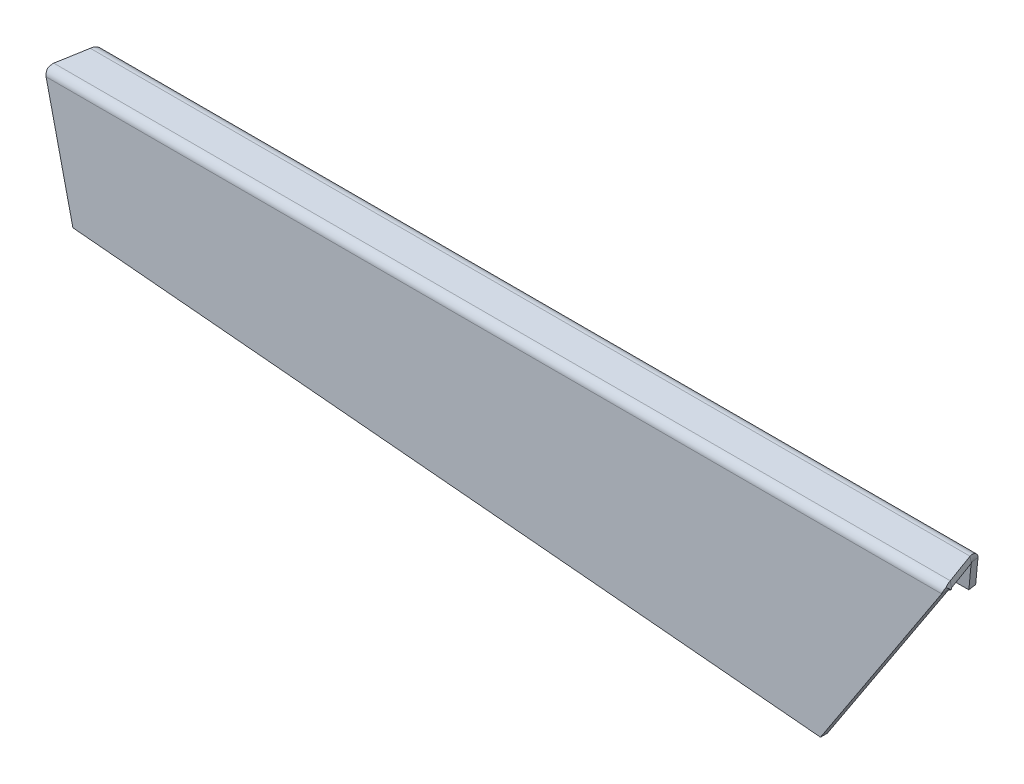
ISO-10303-21;
HEADER;
FILE_DESCRIPTION(('STEP AP214'),'2;1');
FILE_NAME('part.step','',(''),(''),'','','');
FILE_SCHEMA(('AUTOMOTIVE_DESIGN { 1 0 10303 214 1 1 1 1 }'));
ENDSEC;
DATA;
#1=APPLICATION_CONTEXT('core data for automotive mechanical design processes');
#2=APPLICATION_PROTOCOL_DEFINITION('international standard','automotive_design',2000,#1);
#3=PRODUCT_CONTEXT('',#1,'mechanical');
#4=PRODUCT('Part','Part','',(#3));
#5=PRODUCT_RELATED_PRODUCT_CATEGORY('part','',(#4));
#6=PRODUCT_DEFINITION_FORMATION('','',#4);
#7=PRODUCT_DEFINITION_CONTEXT('part definition',#1,'design');
#8=PRODUCT_DEFINITION('design','',#6,#7);
#9=PRODUCT_DEFINITION_SHAPE('','',#8);
#10=(LENGTH_UNIT() NAMED_UNIT(*) SI_UNIT(.MILLI.,.METRE.));
#11=(NAMED_UNIT(*) PLANE_ANGLE_UNIT() SI_UNIT($,.RADIAN.));
#12=(NAMED_UNIT(*) SI_UNIT($,.STERADIAN.) SOLID_ANGLE_UNIT());
#13=UNCERTAINTY_MEASURE_WITH_UNIT(LENGTH_MEASURE(1.E-05),#10,'distance_accuracy_value','');
#14=(GEOMETRIC_REPRESENTATION_CONTEXT(3) GLOBAL_UNCERTAINTY_ASSIGNED_CONTEXT((#13)) GLOBAL_UNIT_ASSIGNED_CONTEXT((#10,
#11,#12)) REPRESENTATION_CONTEXT('',''));
#15=CARTESIAN_POINT('',(0.,0.,0.));
#16=DIRECTION('',(0.,0.,1.));
#17=DIRECTION('',(1.,0.,0.));
#18=AXIS2_PLACEMENT_3D('',#15,#16,#17);
#19=CARTESIAN_POINT('',(-143.,-40.8018532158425,217.160539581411));
#20=DIRECTION('',(0.,0.984807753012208,0.173648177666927));
#21=DIRECTION('',(1.,0.,0.));
#22=AXIS2_PLACEMENT_3D('',#19,#20,#21);
#23=PLANE('',#22);
#24=DIRECTION('',(-0.351123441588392,-0.162591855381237,0.92210423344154));
#25=VECTOR('',#24,1.);
#26=CARTESIAN_POINT('',(-1010.,10.9453037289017,-76.3121708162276));
#27=LINE('',#26,#25);
#28=CARTESIAN_POINT('',(-1026.76714586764,3.18107886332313,-32.2790634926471));
#29=VERTEX_POINT('',#28);
#30=CARTESIAN_POINT('',(-1038.42920367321,-2.21917469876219,-1.65270364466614));
#31=VERTEX_POINT('',#30);
#32=EDGE_CURVE('E600',#29,#31,#27,.T.);
#33=ORIENTED_EDGE('',*,*,#32,.F.);
#34=DIRECTION('',(1.,0.,0.));
#35=VECTOR('',#34,1.);
#36=CARTESIAN_POINT('',(-143.,3.18107886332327,-32.2790634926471));
#37=LINE('',#36,#35);
#38=CARTESIAN_POINT('',(-8.82190275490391,3.18107886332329,-32.2790634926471));
#39=VERTEX_POINT('',#38);
#40=EDGE_CURVE('E99',#29,#39,#37,.T.);
#41=ORIENTED_EDGE('',*,*,#40,.T.);
#42=DIRECTION('',(-0.242535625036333,0.168463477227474,-0.95540385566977));
#43=VECTOR('',#42,1.);
#44=CARTESIAN_POINT('',(0.,-2.94655048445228,2.47244942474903));
#45=LINE('',#44,#43);
#46=CARTESIAN_POINT('',(-1.04719755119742,-2.21917469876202,-1.65270364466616));
#47=VERTEX_POINT('',#46);
#48=EDGE_CURVE('E523',#47,#39,#45,.T.);
#49=ORIENTED_EDGE('',*,*,#48,.F.);
#50=DIRECTION('',(1.,0.,0.));
#51=VECTOR('',#50,1.);
#52=CARTESIAN_POINT('',(-143.,-2.21917469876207,-1.65270364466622));
#53=LINE('',#52,#51);
#54=EDGE_CURVE('E629',#31,#47,#53,.T.);
#55=ORIENTED_EDGE('',*,*,#54,.F.);
#56=EDGE_LOOP('',(#33,#41,#49,#55));
#57=FACE_BOUND('',#56,.T.);
#58=ADVANCED_FACE('F87',(#57),#23,.F.);
#59=CARTESIAN_POINT('',(-1010.,18.8237657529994,-74.9229853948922));
#60=DIRECTION('',(0.936329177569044,-0.060971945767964,0.345789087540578));
#61=DIRECTION('',(0.351123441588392,0.162591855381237,-0.92210423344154));
#62=AXIS2_PLACEMENT_3D('',#59,#60,#61);
#63=PLANE('',#62);
#64=DIRECTION('',(-0.351123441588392,-0.162591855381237,0.92210423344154));
#65=VECTOR('',#64,1.);
#66=CARTESIAN_POINT('',(-1010.,18.8237657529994,-74.9229853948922));
#67=LINE('',#66,#65);
#68=CARTESIAN_POINT('',(-1026.76714586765,11.0595408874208,-30.8898780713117));
#69=VERTEX_POINT('',#68);
#70=CARTESIAN_POINT('',(-1038.42920367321,5.65928732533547,-0.26351822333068));
#71=VERTEX_POINT('',#70);
#72=EDGE_CURVE('E594',#69,#71,#67,.T.);
#73=ORIENTED_EDGE('',*,*,#72,.F.);
#74=CARTESIAN_POINT('',(-1026.76714586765,3.18107886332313,-32.2790634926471));
#75=CARTESIAN_POINT('',(-1026.76714586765,11.0595408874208,-30.8898780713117));
#76=B_SPLINE_CURVE_WITH_KNOTS('',1,(#74,#75),.UNSPECIFIED.,.F.,.F.,(2,2),(0.,1.),.UNSPECIFIED.);
#77=EDGE_CURVE('E12',#69,#29,#76,.F.);
#78=ORIENTED_EDGE('',*,*,#77,.T.);
#79=ORIENTED_EDGE('',*,*,#32,.T.);
#80=CARTESIAN_POINT('',(-1038.42920367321,5.65928732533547,-0.26351822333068));
#81=CARTESIAN_POINT('',(-1038.42920367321,-2.21917469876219,-1.65270364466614));
#82=B_SPLINE_CURVE_WITH_KNOTS('',1,(#80,#81),.UNSPECIFIED.,.F.,.F.,(2,2),(0.,1.),.UNSPECIFIED.);
#83=EDGE_CURVE('E477',#71,#31,#82,.T.);
#84=ORIENTED_EDGE('',*,*,#83,.F.);
#85=EDGE_LOOP('',(#73,#78,#79,#84));
#86=FACE_BOUND('',#85,.T.);
#87=ADVANCED_FACE('F89',(#86),#63,.F.);
#88=CARTESIAN_POINT('',(0.,4.93191153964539,3.86163484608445));
#89=DIRECTION('',(-0.970142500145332,-0.0421158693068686,0.238850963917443));
#90=DIRECTION('',(0.242535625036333,-0.168463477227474,0.95540385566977));
#91=AXIS2_PLACEMENT_3D('',#88,#89,#90);
#92=PLANE('',#91);
#93=ORIENTED_EDGE('',*,*,#48,.T.);
#94=CARTESIAN_POINT('',(-8.82190275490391,11.059540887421,-30.8898780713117));
#95=CARTESIAN_POINT('',(-8.82190275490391,3.18107886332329,-32.2790634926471));
#96=B_SPLINE_CURVE_WITH_KNOTS('',1,(#94,#95),.UNSPECIFIED.,.F.,.F.,(2,2),(0.,1.),.UNSPECIFIED.);
#97=CARTESIAN_POINT('',(-8.82190275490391,11.059540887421,-30.8898780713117));
#98=VERTEX_POINT('',#97);
#99=EDGE_CURVE('E331',#39,#98,#96,.F.);
#100=ORIENTED_EDGE('',*,*,#99,.T.);
#101=DIRECTION('',(-0.242535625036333,0.168463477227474,-0.95540385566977));
#102=VECTOR('',#101,1.);
#103=CARTESIAN_POINT('',(0.,4.93191153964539,3.86163484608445));
#104=LINE('',#103,#102);
#105=CARTESIAN_POINT('',(-1.0471975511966,5.65928732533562,-0.263518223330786));
#106=VERTEX_POINT('',#105);
#107=EDGE_CURVE('E597',#106,#98,#104,.T.);
#108=ORIENTED_EDGE('',*,*,#107,.F.);
#109=CARTESIAN_POINT('',(-1.04719755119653,-2.21917469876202,-1.65270364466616));
#110=CARTESIAN_POINT('',(-1.04719755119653,5.65928732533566,-0.26351822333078));
#111=B_SPLINE_CURVE_WITH_KNOTS('',1,(#109,#110),.UNSPECIFIED.,.F.,.F.,(2,2),(0.,1.),.UNSPECIFIED.);
#112=EDGE_CURVE('E489',#47,#106,#111,.T.);
#113=ORIENTED_EDGE('',*,*,#112,.F.);
#114=EDGE_LOOP('',(#93,#100,#108,#113));
#115=FACE_BOUND('',#114,.T.);
#116=ADVANCED_FACE('F627',(#115),#92,.F.);
#117=CARTESIAN_POINT('',(-143.,-32.9233911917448,218.549725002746));
#118=DIRECTION('',(0.,0.984807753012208,0.173648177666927));
#119=DIRECTION('',(1.,0.,0.));
#120=AXIS2_PLACEMENT_3D('',#117,#118,#119);
#121=PLANE('',#120);
#122=DIRECTION('',(1.,0.,0.));
#123=VECTOR('',#122,1.);
#124=CARTESIAN_POINT('',(-143.,11.0595408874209,-30.8898780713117));
#125=LINE('',#124,#123);
#126=EDGE_CURVE('E628',#69,#98,#125,.T.);
#127=ORIENTED_EDGE('',*,*,#126,.F.);
#128=ORIENTED_EDGE('',*,*,#72,.T.);
#129=DIRECTION('',(1.,0.,0.));
#130=VECTOR('',#129,1.);
#131=CARTESIAN_POINT('',(-143.,5.65928732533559,-0.263518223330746));
#132=LINE('',#131,#130);
#133=EDGE_CURVE('E592',#71,#106,#132,.T.);
#134=ORIENTED_EDGE('',*,*,#133,.T.);
#135=ORIENTED_EDGE('',*,*,#107,.T.);
#136=EDGE_LOOP('',(#127,#128,#134,#135));
#137=FACE_BOUND('',#136,.T.);
#138=ADVANCED_FACE('F574',(#137),#121,.T.);
#139=CARTESIAN_POINT('',(-1008.,-140.,8.));
#140=DIRECTION('',(0.0898090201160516,0.99595900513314,0.));
#141=DIRECTION('',(-0.99595900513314,0.0898090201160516,0.));
#142=AXIS2_PLACEMENT_3D('',#139,#140,#141);
#143=PLANE('',#142);
#144=DIRECTION('',(0.99595900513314,-0.0898090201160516,0.));
#145=VECTOR('',#144,1.);
#146=CARTESIAN_POINT('',(-1008.,-140.,0.));
#147=LINE('',#146,#145);
#148=CARTESIAN_POINT('',(-1008.,-140.,0.));
#149=VERTEX_POINT('',#148);
#150=CARTESIAN_POINT('',(-143.,-218.,0.));
#151=VERTEX_POINT('',#150);
#152=EDGE_CURVE('E532',#149,#151,#147,.T.);
#153=ORIENTED_EDGE('',*,*,#152,.T.);
#154=DIRECTION('',(0.,0.,-1.));
#155=VECTOR('',#154,1.);
#156=CARTESIAN_POINT('',(-143.,-218.,8.));
#157=LINE('',#156,#155);
#158=CARTESIAN_POINT('',(-143.,-218.,8.));
#159=VERTEX_POINT('',#158);
#160=EDGE_CURVE('E515',#159,#151,#157,.T.);
#161=ORIENTED_EDGE('',*,*,#160,.F.);
#162=DIRECTION('',(0.99595900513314,-0.0898090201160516,0.));
#163=VECTOR('',#162,1.);
#164=CARTESIAN_POINT('',(-1008.,-140.,8.));
#165=LINE('',#164,#163);
#166=CARTESIAN_POINT('',(-1008.,-140.,8.));
#167=VERTEX_POINT('',#166);
#168=EDGE_CURVE('E525',#167,#159,#165,.T.);
#169=ORIENTED_EDGE('',*,*,#168,.F.);
#170=DIRECTION('',(0.,0.,-1.));
#171=VECTOR('',#170,1.);
#172=CARTESIAN_POINT('',(-1008.,-140.,8.));
#173=LINE('',#172,#171);
#174=EDGE_CURVE('E529',#167,#149,#173,.T.);
#175=ORIENTED_EDGE('',*,*,#174,.T.);
#176=EDGE_LOOP('',(#153,#161,#169,#175));
#177=FACE_BOUND('',#176,.T.);
#178=ADVANCED_FACE('F704',(#177),#143,.F.);
#179=CARTESIAN_POINT('',(-143.,-218.,8.));
#180=DIRECTION('',(0.,0.,1.));
#181=DIRECTION('',(1.,0.,0.));
#182=AXIS2_PLACEMENT_3D('',#179,#180,#181);
#183=PLANE('',#182);
#184=DIRECTION('',(1.,0.,0.));
#185=VECTOR('',#184,1.);
#186=CARTESIAN_POINT('',(-143.,-4.18879020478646,8.));
#187=LINE('',#186,#185);
#188=CARTESIAN_POINT('',(-1039.04256223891,-4.18879020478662,8.));
#189=VERTEX_POINT('',#188);
#190=CARTESIAN_POINT('',(-2.74769265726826,-4.18879020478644,8.));
#191=VERTEX_POINT('',#190);
#192=EDGE_CURVE('E534',#189,#191,#187,.T.);
#193=ORIENTED_EDGE('',*,*,#192,.F.);
#194=DIRECTION('',(0.222824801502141,-0.974858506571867,0.));
#195=VECTOR('',#194,1.);
#196=CARTESIAN_POINT('',(-1040.,-1.27363267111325E-13,8.));
#197=LINE('',#196,#195);
#198=EDGE_CURVE('E528',#189,#167,#197,.T.);
#199=ORIENTED_EDGE('',*,*,#198,.T.);
#200=ORIENTED_EDGE('',*,*,#168,.T.);
#201=DIRECTION('',(0.54848886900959,0.836157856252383,0.));
#202=VECTOR('',#201,1.);
#203=CARTESIAN_POINT('',(0.,0.,8.));
#204=LINE('',#203,#202);
#205=EDGE_CURVE('E527',#159,#191,#204,.T.);
#206=ORIENTED_EDGE('',*,*,#205,.T.);
#207=EDGE_LOOP('',(#193,#199,#200,#206));
#208=FACE_BOUND('',#207,.T.);
#209=ADVANCED_FACE('F566',(#208),#183,.T.);
#210=CARTESIAN_POINT('',(-1040.,-1.27363267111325E-13,8.));
#211=DIRECTION('',(0.974858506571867,0.222824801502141,0.));
#212=DIRECTION('',(-0.222824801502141,0.974858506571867,0.));
#213=AXIS2_PLACEMENT_3D('',#210,#211,#212);
#214=PLANE('',#213);
#215=ORIENTED_EDGE('',*,*,#198,.F.);
#216=CARTESIAN_POINT('',(-1039.04256223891,-4.18879020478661,0.));
#217=CARTESIAN_POINT('',(-1039.04256223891,-4.18879020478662,8.));
#218=B_SPLINE_CURVE_WITH_KNOTS('',1,(#216,#217),.UNSPECIFIED.,.F.,.F.,(2,2),(0.,1.),.UNSPECIFIED.);
#219=CARTESIAN_POINT('',(-1039.04256223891,-4.18879020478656,0.));
#220=VERTEX_POINT('',#219);
#221=EDGE_CURVE('E543',#189,#220,#218,.F.);
#222=ORIENTED_EDGE('',*,*,#221,.T.);
#223=DIRECTION('',(0.222824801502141,-0.974858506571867,0.));
#224=VECTOR('',#223,1.);
#225=CARTESIAN_POINT('',(-1040.,-1.27363267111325E-13,0.));
#226=LINE('',#225,#224);
#227=EDGE_CURVE('E539',#220,#149,#226,.T.);
#228=ORIENTED_EDGE('',*,*,#227,.T.);
#229=ORIENTED_EDGE('',*,*,#174,.F.);
#230=EDGE_LOOP('',(#215,#222,#228,#229));
#231=FACE_BOUND('',#230,.T.);
#232=ADVANCED_FACE('F555',(#231),#214,.F.);
#233=CARTESIAN_POINT('',(-143.,-218.,0.));
#234=DIRECTION('',(0.,0.,1.));
#235=DIRECTION('',(1.,0.,0.));
#236=AXIS2_PLACEMENT_3D('',#233,#234,#235);
#237=PLANE('',#236);
#238=ORIENTED_EDGE('',*,*,#227,.F.);
#239=DIRECTION('',(1.,0.,0.));
#240=VECTOR('',#239,1.);
#241=CARTESIAN_POINT('',(-143.,-4.18879020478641,0.));
#242=LINE('',#241,#240);
#243=CARTESIAN_POINT('',(-2.74769265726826,-4.18879020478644,0.));
#244=VERTEX_POINT('',#243);
#245=EDGE_CURVE('E535',#220,#244,#242,.T.);
#246=ORIENTED_EDGE('',*,*,#245,.T.);
#247=DIRECTION('',(0.54848886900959,0.836157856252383,0.));
#248=VECTOR('',#247,1.);
#249=CARTESIAN_POINT('',(0.,0.,0.));
#250=LINE('',#249,#248);
#251=EDGE_CURVE('E538',#151,#244,#250,.T.);
#252=ORIENTED_EDGE('',*,*,#251,.F.);
#253=ORIENTED_EDGE('',*,*,#152,.F.);
#254=EDGE_LOOP('',(#238,#246,#252,#253));
#255=FACE_BOUND('',#254,.T.);
#256=ADVANCED_FACE('F565',(#255),#237,.F.);
#257=CARTESIAN_POINT('',(0.,0.,8.));
#258=DIRECTION('',(-0.836157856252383,0.54848886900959,0.));
#259=DIRECTION('',(-0.54848886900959,-0.836157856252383,0.));
#260=AXIS2_PLACEMENT_3D('',#257,#258,#259);
#261=PLANE('',#260);
#262=ORIENTED_EDGE('',*,*,#251,.T.);
#263=CARTESIAN_POINT('',(-2.74769265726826,-4.18879020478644,8.));
#264=CARTESIAN_POINT('',(-2.74769265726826,-4.18879020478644,0.));
#265=B_SPLINE_CURVE_WITH_KNOTS('',1,(#263,#264),.UNSPECIFIED.,.F.,.F.,(2,2),(0.,1.),.UNSPECIFIED.);
#266=EDGE_CURVE('E524',#244,#191,#265,.F.);
#267=ORIENTED_EDGE('',*,*,#266,.T.);
#268=ORIENTED_EDGE('',*,*,#205,.F.);
#269=ORIENTED_EDGE('',*,*,#160,.T.);
#270=EDGE_LOOP('',(#262,#267,#268,#269));
#271=FACE_BOUND('',#270,.T.);
#272=ADVANCED_FACE('F436',(#271),#261,.F.);
#273=CARTESIAN_POINT('',(-1038.42920367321,5.65928732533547,-0.26351822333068));
#274=CARTESIAN_POINT('',(-1038.95491792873,5.25355700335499,2.03749277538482));
#275=CARTESIAN_POINT('',(-1039.47428574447,4.02895471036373,4.15856616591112));
#276=CARTESIAN_POINT('',(-1040.,2.2390858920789,5.66044443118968));
#277=CARTESIAN_POINT('',(-1038.42920367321,-2.21917469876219,-1.65270364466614));
#278=CARTESIAN_POINT('',(-1038.95405292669,-2.30018724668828,-1.19325865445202));
#279=CARTESIAN_POINT('',(-1039.47515074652,-2.54583022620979,-0.767792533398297));
#280=CARTESIAN_POINT('',(-1040.,-2.90321498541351,-0.467911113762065));
#281=B_SPLINE_SURFACE_WITH_KNOTS('',1,3,((#273,#274,#275,#276),(#277,#278,#279,#280)),
.UNSPECIFIED.,.F.,.F.,.F.,(2,2),(4,4),(0.,1.),(0.,1.),.UNSPECIFIED.);
#282=CARTESIAN_POINT('',(-1038.42920367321,-2.21917469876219,-1.65270364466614));
#283=CARTESIAN_POINT('',(-1038.95405292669,-2.30018724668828,-1.19325865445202));
#284=CARTESIAN_POINT('',(-1039.47515074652,-2.54583022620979,-0.767792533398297));
#285=CARTESIAN_POINT('',(-1040.,-2.90321498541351,-0.467911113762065));
#286=B_SPLINE_CURVE_WITH_KNOTS('',3,(#282,#283,#284,#285),.UNSPECIFIED.,.F.,.F.,(4,4),(0.,1.),.UNSPECIFIED.);
#287=CARTESIAN_POINT('',(-1040.,-2.90321498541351,-0.467911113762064));
#288=VERTEX_POINT('',#287);
#289=EDGE_CURVE('E639',#31,#288,#286,.T.);
#290=CARTESIAN_POINT('',(-1040.,-2.90321498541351,-0.467911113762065));
#291=CARTESIAN_POINT('',(-1040.,2.2390858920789,5.66044443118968));
#292=B_SPLINE_CURVE_WITH_KNOTS('',1,(#290,#291),.UNSPECIFIED.,.F.,.F.,(2,2),(0.,1.),.UNSPECIFIED.);
#293=CARTESIAN_POINT('',(-1040.,2.2390858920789,5.66044443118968));
#294=VERTEX_POINT('',#293);
#295=EDGE_CURVE('E467',#288,#294,#292,.T.);
#296=CARTESIAN_POINT('',(-1040.,2.2390858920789,5.66044443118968));
#297=CARTESIAN_POINT('',(-1039.47428574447,4.02895471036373,4.15856616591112));
#298=CARTESIAN_POINT('',(-1038.95491792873,5.25355700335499,2.03749277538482));
#299=CARTESIAN_POINT('',(-1038.42920367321,5.65928732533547,-0.26351822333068));
#300=B_SPLINE_CURVE_WITH_KNOTS('',3,(#296,#297,#298,#299),.UNSPECIFIED.,.F.,.F.,(4,4),(0.,1.),.UNSPECIFIED.);
#301=EDGE_CURVE('E419',#71,#294,#300,.F.);
#302=ORIENTED_EDGE('',*,*,#83,.T.);
#303=ORIENTED_EDGE('',*,*,#289,.T.);
#304=ORIENTED_EDGE('',*,*,#295,.T.);
#305=ORIENTED_EDGE('',*,*,#301,.F.);
#306=EDGE_LOOP('',(#302,#303,#304,#305));
#307=FACE_BOUND('',#306,.T.);
#308=ADVANCED_FACE('F424',(#307),#281,.T.);
#309=CARTESIAN_POINT('',(-1040.,2.2390858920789,5.66044443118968));
#310=CARTESIAN_POINT('',(-1039.67954085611,0.449084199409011,7.16243419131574));
#311=CARTESIAN_POINT('',(-1039.3630213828,-1.85210894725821,8.));
#312=CARTESIAN_POINT('',(-1039.04256223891,-4.18879020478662,8.));
#313=CARTESIAN_POINT('',(-1040.,-2.90321498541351,-0.467911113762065));
#314=CARTESIAN_POINT('',(-1039.67981327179,-3.26091099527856,-0.167768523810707));
#315=CARTESIAN_POINT('',(-1039.36274896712,-3.72185122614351,0.));
#316=CARTESIAN_POINT('',(-1039.04256223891,-4.18879020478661,0.));
#317=B_SPLINE_SURFACE_WITH_KNOTS('',1,3,((#309,#310,#311,#312),(#313,#314,#315,#316)),
.UNSPECIFIED.,.F.,.F.,.F.,(2,2),(4,4),(0.,1.),(0.,1.),.UNSPECIFIED.);
#318=CARTESIAN_POINT('',(-1040.,-2.90321498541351,-0.467911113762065));
#319=CARTESIAN_POINT('',(-1039.67981327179,-3.26091099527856,-0.167768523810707));
#320=CARTESIAN_POINT('',(-1039.36274896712,-3.72185122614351,0.));
#321=CARTESIAN_POINT('',(-1039.04256223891,-4.18879020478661,0.));
#322=B_SPLINE_CURVE_WITH_KNOTS('',3,(#318,#319,#320,#321),.UNSPECIFIED.,.F.,.F.,(4,4),(0.,1.),.UNSPECIFIED.);
#323=EDGE_CURVE('E689',#288,#220,#322,.T.);
#324=CARTESIAN_POINT('',(-1039.04256223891,-4.18879020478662,8.));
#325=CARTESIAN_POINT('',(-1039.3630213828,-1.85210894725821,8.));
#326=CARTESIAN_POINT('',(-1039.67954085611,0.449084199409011,7.16243419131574));
#327=CARTESIAN_POINT('',(-1040.,2.2390858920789,5.66044443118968));
#328=B_SPLINE_CURVE_WITH_KNOTS('',3,(#324,#325,#326,#327),.UNSPECIFIED.,.F.,.F.,(4,4),(0.,1.),.UNSPECIFIED.);
#329=EDGE_CURVE('E672',#294,#189,#328,.F.);
#330=ORIENTED_EDGE('',*,*,#295,.F.);
#331=ORIENTED_EDGE('',*,*,#323,.T.);
#332=ORIENTED_EDGE('',*,*,#221,.F.);
#333=ORIENTED_EDGE('',*,*,#329,.F.);
#334=EDGE_LOOP('',(#330,#331,#332,#333));
#335=FACE_BOUND('',#334,.T.);
#336=ADVANCED_FACE('F435',(#335),#317,.T.);
#337=CARTESIAN_POINT('',(-2.74769265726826,-4.18879020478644,8.));
#338=CARTESIAN_POINT('',(-1.82830201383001,-1.85280931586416,8.));
#339=CARTESIAN_POINT('',(-0.91939064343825,0.449620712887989,7.16198400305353));
#340=CARTESIAN_POINT('',(0.,2.23908589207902,5.66044443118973));
#341=CARTESIAN_POINT('',(-2.74769265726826,-4.18879020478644,0.));
#342=CARTESIAN_POINT('',(-1.83062995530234,-3.72277699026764,0.));
#343=CARTESIAN_POINT('',(-0.917062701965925,-3.26020181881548,-0.168363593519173));
#344=CARTESIAN_POINT('',(0.,-2.90321498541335,-0.467911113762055));
#345=B_SPLINE_SURFACE_WITH_KNOTS('',1,3,((#337,#338,#339,#340),(#341,#342,#343,#344)),
.UNSPECIFIED.,.F.,.F.,.F.,(2,2),(4,4),(0.,1.),(0.,1.),.UNSPECIFIED.);
#346=CARTESIAN_POINT('',(-2.74769265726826,-4.18879020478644,0.));
#347=CARTESIAN_POINT('',(-1.83062995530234,-3.72277699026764,0.));
#348=CARTESIAN_POINT('',(-0.917062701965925,-3.26020181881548,-0.168363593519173));
#349=CARTESIAN_POINT('',(0.,-2.90321498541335,-0.467911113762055));
#350=B_SPLINE_CURVE_WITH_KNOTS('',3,(#346,#347,#348,#349),.UNSPECIFIED.,.F.,.F.,(4,4),(0.,1.),.UNSPECIFIED.);
#351=CARTESIAN_POINT('',(0.,-2.90321498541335,-0.467911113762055));
#352=VERTEX_POINT('',#351);
#353=EDGE_CURVE('E642',#244,#352,#350,.T.);
#354=CARTESIAN_POINT('',(0.,-2.90321498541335,-0.467911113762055));
#355=CARTESIAN_POINT('',(0.,2.23908589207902,5.66044443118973));
#356=B_SPLINE_CURVE_WITH_KNOTS('',1,(#354,#355),.UNSPECIFIED.,.F.,.F.,(2,2),(0.,1.),.UNSPECIFIED.);
#357=CARTESIAN_POINT('',(0.,2.23908589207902,5.66044443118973));
#358=VERTEX_POINT('',#357);
#359=EDGE_CURVE('E502',#352,#358,#356,.T.);
#360=CARTESIAN_POINT('',(0.,2.23908589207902,5.66044443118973));
#361=CARTESIAN_POINT('',(-0.91939064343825,0.449620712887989,7.16198400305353));
#362=CARTESIAN_POINT('',(-1.82830201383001,-1.85280931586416,8.));
#363=CARTESIAN_POINT('',(-2.74769265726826,-4.18879020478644,8.));
#364=B_SPLINE_CURVE_WITH_KNOTS('',3,(#360,#361,#362,#363),.UNSPECIFIED.,.F.,.F.,(4,4),(0.,1.),.UNSPECIFIED.);
#365=EDGE_CURVE('E350',#191,#358,#364,.F.);
#366=ORIENTED_EDGE('',*,*,#266,.F.);
#367=ORIENTED_EDGE('',*,*,#353,.T.);
#368=ORIENTED_EDGE('',*,*,#359,.T.);
#369=ORIENTED_EDGE('',*,*,#365,.F.);
#370=EDGE_LOOP('',(#366,#367,#368,#369));
#371=FACE_BOUND('',#370,.T.);
#372=ADVANCED_FACE('F386',(#371),#345,.T.);
#373=CARTESIAN_POINT('',(0.,2.23908589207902,5.66044443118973));
#374=CARTESIAN_POINT('',(-0.350499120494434,4.02907191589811,4.15846781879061));
#375=CARTESIAN_POINT('',(-0.696698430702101,5.25353043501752,2.03764345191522));
#376=CARTESIAN_POINT('',(-1.04719755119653,5.65928732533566,-0.26351822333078));
#377=CARTESIAN_POINT('',(0.,-2.90321498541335,-0.467911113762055));
#378=CARTESIAN_POINT('',(-0.350157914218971,-2.54556628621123,-0.768014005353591));
#379=CARTESIAN_POINT('',(-0.697039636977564,-2.30024707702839,-1.19291933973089));
#380=CARTESIAN_POINT('',(-1.04719755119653,-2.21917469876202,-1.65270364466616));
#381=B_SPLINE_SURFACE_WITH_KNOTS('',1,3,((#373,#374,#375,#376),(#377,#378,#379,#380)),
.UNSPECIFIED.,.F.,.F.,.F.,(2,2),(4,4),(0.,1.),(0.,1.),.UNSPECIFIED.);
#382=CARTESIAN_POINT('',(0.,-2.90321498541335,-0.467911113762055));
#383=CARTESIAN_POINT('',(-0.350157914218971,-2.54556628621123,-0.768014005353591));
#384=CARTESIAN_POINT('',(-0.697039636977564,-2.30024707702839,-1.19291933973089));
#385=CARTESIAN_POINT('',(-1.04719755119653,-2.21917469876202,-1.65270364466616));
#386=B_SPLINE_CURVE_WITH_KNOTS('',3,(#382,#383,#384,#385),.UNSPECIFIED.,.F.,.F.,(4,4),(0.,1.),.UNSPECIFIED.);
#387=EDGE_CURVE('E371',#352,#47,#386,.T.);
#388=CARTESIAN_POINT('',(-1.04719755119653,5.65928732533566,-0.26351822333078));
#389=CARTESIAN_POINT('',(-0.696698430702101,5.25353043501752,2.03764345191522));
#390=CARTESIAN_POINT('',(-0.350499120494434,4.02907191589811,4.15846781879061));
#391=CARTESIAN_POINT('',(0.,2.23908589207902,5.66044443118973));
#392=B_SPLINE_CURVE_WITH_KNOTS('',3,(#388,#389,#390,#391),.UNSPECIFIED.,.F.,.F.,(4,4),(0.,1.),.UNSPECIFIED.);
#393=EDGE_CURVE('E115',#358,#106,#392,.F.);
#394=ORIENTED_EDGE('',*,*,#387,.T.);
#395=ORIENTED_EDGE('',*,*,#112,.T.);
#396=ORIENTED_EDGE('',*,*,#393,.F.);
#397=ORIENTED_EDGE('',*,*,#359,.F.);
#398=EDGE_LOOP('',(#394,#395,#396,#397));
#399=FACE_BOUND('',#398,.T.);
#400=ADVANCED_FACE('F385',(#399),#381,.T.);
#401=CARTESIAN_POINT('',(519.169382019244,-4.18879020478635,-2.));
#402=DIRECTION('',(-1.,0.,0.));
#403=DIRECTION('',(0.,-1.,0.));
#404=AXIS2_PLACEMENT_3D('',#401,#402,#403);
#405=CYLINDRICAL_SURFACE('',#404,10.);
#406=ORIENTED_EDGE('',*,*,#365,.T.);
#407=ORIENTED_EDGE('',*,*,#393,.T.);
#408=ORIENTED_EDGE('',*,*,#133,.F.);
#409=ORIENTED_EDGE('',*,*,#301,.T.);
#410=ORIENTED_EDGE('',*,*,#329,.T.);
#411=ORIENTED_EDGE('',*,*,#192,.T.);
#412=EDGE_LOOP('',(#406,#407,#408,#409,#410,#411));
#413=FACE_BOUND('',#412,.T.);
#414=ADVANCED_FACE('F304',(#413),#405,.T.);
#415=CARTESIAN_POINT('',(519.169382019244,-4.18879020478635,-2.));
#416=DIRECTION('',(-1.,0.,0.));
#417=DIRECTION('',(0.,-1.,0.));
#418=AXIS2_PLACEMENT_3D('',#415,#416,#417);
#419=CYLINDRICAL_SURFACE('',#418,2.);
#420=ORIENTED_EDGE('',*,*,#353,.F.);
#421=ORIENTED_EDGE('',*,*,#245,.F.);
#422=ORIENTED_EDGE('',*,*,#323,.F.);
#423=ORIENTED_EDGE('',*,*,#289,.F.);
#424=ORIENTED_EDGE('',*,*,#54,.T.);
#425=ORIENTED_EDGE('',*,*,#387,.F.);
#426=EDGE_LOOP('',(#420,#421,#422,#423,#424,#425));
#427=FACE_BOUND('',#426,.T.);
#428=ADVANCED_FACE('F376',(#427),#419,.F.);
#429=CARTESIAN_POINT('',(-1023.23285413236,2.94794513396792,-42.4744373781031));
#430=CARTESIAN_POINT('',(-1023.52742898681,4.23727669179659,-42.247093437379));
#431=CARTESIAN_POINT('',(-1023.8219027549,5.48046261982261,-41.7635978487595));
#432=CARTESIAN_POINT('',(-1024.41095137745,7.68845626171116,-40.3569507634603));
#433=CARTESIAN_POINT('',(-1024.70547568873,8.65217400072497,-39.4343917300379));
#434=CARTESIAN_POINT('',(-1025.29452431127,10.1537935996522,-37.2898566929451));
#435=CARTESIAN_POINT('',(-1025.58904862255,10.6911046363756,-36.0687244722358));
#436=CARTESIAN_POINT('',(-1026.1780972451,11.2577422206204,-33.5127875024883));
#437=CARTESIAN_POINT('',(-1026.47257101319,11.2868848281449,-32.1792096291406));
#438=CARTESIAN_POINT('',(-1026.76714586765,11.0595408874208,-30.8898780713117));
#439=CARTESIAN_POINT('',(-1023.23285413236,1.55875971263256,-34.5959753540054));
#440=CARTESIAN_POINT('',(-1023.52740188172,1.81660229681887,-34.5505107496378));
#441=CARTESIAN_POINT('',(-1023.8219027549,2.06526320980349,-34.4538074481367));
#442=CARTESIAN_POINT('',(-1024.41095137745,2.5068619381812,-34.1724780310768));
#443=CARTESIAN_POINT('',(-1024.70547568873,2.69960548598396,-33.9879662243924));
#444=CARTESIAN_POINT('',(-1025.29452431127,2.99992940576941,-33.5590592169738));
#445=CARTESIAN_POINT('',(-1025.58904862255,3.1073916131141,-33.314832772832));
#446=CARTESIAN_POINT('',(-1026.1780972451,3.22071912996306,-32.8036453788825));
#447=CARTESIAN_POINT('',(-1026.47259811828,3.22654346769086,-32.5369060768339));
#448=CARTESIAN_POINT('',(-1026.76714586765,3.18107886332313,-32.2790634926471));
#449=B_SPLINE_SURFACE_WITH_KNOTS('',1,3,((#429,#430,#431,#432,#433,#434,#435,#436,#437,#438),
(#439,#440,#441,#442,#443,#444,#445,#446,#447,#448)),.UNSPECIFIED.,.F.,.F.,.F.,(2,2),(4,2,2,2,
4),(0.,1.),(0.,0.25,0.5,0.75,1.),.UNSPECIFIED.);
#450=CARTESIAN_POINT('',(-1023.23285413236,2.94794513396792,-42.4744373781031));
#451=CARTESIAN_POINT('',(-1023.23285413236,1.55875971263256,-34.5959753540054));
#452=B_SPLINE_CURVE_WITH_KNOTS('',1,(#450,#451),.UNSPECIFIED.,.F.,.F.,(2,2),(0.,1.),.UNSPECIFIED.);
#453=CARTESIAN_POINT('',(-1023.23285413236,2.94794513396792,-42.4744373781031));
#454=VERTEX_POINT('',#453);
#455=CARTESIAN_POINT('',(-1023.23285413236,1.55875971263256,-34.5959753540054));
#456=VERTEX_POINT('',#455);
#457=EDGE_CURVE('E746',#454,#456,#452,.T.);
#458=CARTESIAN_POINT('',(-1023.23285413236,1.55875971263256,-34.5959753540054));
#459=CARTESIAN_POINT('',(-1023.52740188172,1.81660229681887,-34.5505107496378));
#460=CARTESIAN_POINT('',(-1023.8219027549,2.06526320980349,-34.4538074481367));
#461=CARTESIAN_POINT('',(-1024.41095137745,2.5068619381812,-34.1724780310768));
#462=CARTESIAN_POINT('',(-1024.70547568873,2.69960548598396,-33.9879662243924));
#463=CARTESIAN_POINT('',(-1025.29452431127,2.99992940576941,-33.5590592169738));
#464=CARTESIAN_POINT('',(-1025.58904862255,3.1073916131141,-33.314832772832));
#465=CARTESIAN_POINT('',(-1026.1780972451,3.22071912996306,-32.8036453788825));
#466=CARTESIAN_POINT('',(-1026.47259811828,3.22654346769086,-32.5369060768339));
#467=CARTESIAN_POINT('',(-1026.76714586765,3.18107886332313,-32.2790634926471));
#468=B_SPLINE_CURVE_WITH_KNOTS('',3,(#458,#459,#460,#461,#462,#463,#464,#465,#466,#467),
.UNSPECIFIED.,.F.,.F.,(4,2,2,2,4),(0.,0.25,0.5,0.75,1.),.UNSPECIFIED.);
#469=EDGE_CURVE('E106',#456,#29,#468,.T.);
#470=CARTESIAN_POINT('',(-1026.76714586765,11.0595408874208,-30.8898780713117));
#471=CARTESIAN_POINT('',(-1026.47257101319,11.2868848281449,-32.1792096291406));
#472=CARTESIAN_POINT('',(-1026.1780972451,11.2577422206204,-33.5127875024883));
#473=CARTESIAN_POINT('',(-1025.58904862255,10.6911046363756,-36.0687244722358));
#474=CARTESIAN_POINT('',(-1025.29452431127,10.1537935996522,-37.2898566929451));
#475=CARTESIAN_POINT('',(-1024.70547568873,8.65217400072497,-39.4343917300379));
#476=CARTESIAN_POINT('',(-1024.41095137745,7.68845626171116,-40.3569507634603));
#477=CARTESIAN_POINT('',(-1023.8219027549,5.48046261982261,-41.7635978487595));
#478=CARTESIAN_POINT('',(-1023.52742898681,4.23727669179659,-42.247093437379));
#479=CARTESIAN_POINT('',(-1023.23285413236,2.94794513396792,-42.4744373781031));
#480=B_SPLINE_CURVE_WITH_KNOTS('',3,(#470,#471,#472,#473,#474,#475,#476,#477,#478,#479),
.UNSPECIFIED.,.F.,.F.,(4,2,2,2,4),(0.,0.25,0.5,0.75,1.),.UNSPECIFIED.);
#481=EDGE_CURVE('E724',#454,#69,#480,.F.);
#482=ORIENTED_EDGE('',*,*,#457,.T.);
#483=ORIENTED_EDGE('',*,*,#469,.T.);
#484=ORIENTED_EDGE('',*,*,#77,.F.);
#485=ORIENTED_EDGE('',*,*,#481,.F.);
#486=EDGE_LOOP('',(#482,#483,#484,#485));
#487=FACE_BOUND('',#486,.T.);
#488=ADVANCED_FACE('F245',(#487),#449,.T.);
#489=CARTESIAN_POINT('',(-8.82190275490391,11.059540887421,-30.8898780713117));
#490=CARTESIAN_POINT('',(-9.01828691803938,11.2868859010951,-32.1792157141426));
#491=CARTESIAN_POINT('',(-9.21460183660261,11.2577422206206,-33.5127875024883));
#492=CARTESIAN_POINT('',(-9.60730091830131,10.6911046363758,-36.0687244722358));
#493=CARTESIAN_POINT('',(-9.80365045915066,10.1537935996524,-37.2898566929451));
#494=CARTESIAN_POINT('',(-10.1963495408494,8.65217400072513,-39.4343917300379));
#495=CARTESIAN_POINT('',(-10.3926990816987,7.6884562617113,-40.3569507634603));
#496=CARTESIAN_POINT('',(-10.7853981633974,5.48046261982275,-41.7635978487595));
#497=CARTESIAN_POINT('',(-10.9817130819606,4.23728277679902,-42.2470923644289));
#498=CARTESIAN_POINT('',(-11.1780972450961,2.94794513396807,-42.4744373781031));
#499=CARTESIAN_POINT('',(-8.82190275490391,3.18107886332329,-32.2790634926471));
#500=CARTESIAN_POINT('',(-9.0182749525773,3.22654509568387,-32.5369153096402));
#501=CARTESIAN_POINT('',(-9.21460183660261,3.22071912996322,-32.8036453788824));
#502=CARTESIAN_POINT('',(-9.60730091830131,3.10739161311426,-33.3148327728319));
#503=CARTESIAN_POINT('',(-9.80365045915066,2.99992940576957,-33.5590592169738));
#504=CARTESIAN_POINT('',(-10.1963495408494,2.69960548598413,-33.9879662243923));
#505=CARTESIAN_POINT('',(-10.3926990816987,2.50686193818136,-34.1724780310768));
#506=CARTESIAN_POINT('',(-10.7853981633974,2.06526320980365,-34.4538074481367));
#507=CARTESIAN_POINT('',(-10.9817250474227,1.81661152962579,-34.5505091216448));
#508=CARTESIAN_POINT('',(-11.1780972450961,1.55875971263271,-34.5959753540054));
#509=B_SPLINE_SURFACE_WITH_KNOTS('',1,3,((#489,#490,#491,#492,#493,#494,#495,#496,#497,#498),
(#499,#500,#501,#502,#503,#504,#505,#506,#507,#508)),.UNSPECIFIED.,.F.,.F.,.F.,(2,2),(4,2,2,2,
4),(0.,1.),(0.,0.25,0.5,0.75,1.),.UNSPECIFIED.);
#510=CARTESIAN_POINT('',(-8.82190275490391,3.18107886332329,-32.2790634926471));
#511=CARTESIAN_POINT('',(-9.0182749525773,3.22654509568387,-32.5369153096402));
#512=CARTESIAN_POINT('',(-9.21460183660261,3.22071912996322,-32.8036453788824));
#513=CARTESIAN_POINT('',(-9.60730091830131,3.10739161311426,-33.3148327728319));
#514=CARTESIAN_POINT('',(-9.80365045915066,2.99992940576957,-33.5590592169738));
#515=CARTESIAN_POINT('',(-10.1963495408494,2.69960548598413,-33.9879662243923));
#516=CARTESIAN_POINT('',(-10.3926990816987,2.50686193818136,-34.1724780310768));
#517=CARTESIAN_POINT('',(-10.7853981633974,2.06526320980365,-34.4538074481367));
#518=CARTESIAN_POINT('',(-10.9817250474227,1.81661152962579,-34.5505091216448));
#519=CARTESIAN_POINT('',(-11.1780972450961,1.55875971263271,-34.5959753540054));
#520=B_SPLINE_CURVE_WITH_KNOTS('',3,(#510,#511,#512,#513,#514,#515,#516,#517,#518,#519),
.UNSPECIFIED.,.F.,.F.,(4,2,2,2,4),(0.,0.25,0.5,0.75,1.),.UNSPECIFIED.);
#521=CARTESIAN_POINT('',(-11.1780972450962,1.55875971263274,-34.5959753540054));
#522=VERTEX_POINT('',#521);
#523=EDGE_CURVE('E273',#39,#522,#520,.T.);
#524=CARTESIAN_POINT('',(-11.1780972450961,1.55875971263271,-34.5959753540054));
#525=CARTESIAN_POINT('',(-11.1780972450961,2.94794513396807,-42.4744373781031));
#526=B_SPLINE_CURVE_WITH_KNOTS('',1,(#524,#525),.UNSPECIFIED.,.F.,.F.,(2,2),(0.,1.),.UNSPECIFIED.);
#527=CARTESIAN_POINT('',(-11.1780972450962,2.94794513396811,-42.4744373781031));
#528=VERTEX_POINT('',#527);
#529=EDGE_CURVE('E204',#522,#528,#526,.T.);
#530=CARTESIAN_POINT('',(-11.1780972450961,2.94794513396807,-42.4744373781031));
#531=CARTESIAN_POINT('',(-10.9817130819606,4.23728277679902,-42.2470923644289));
#532=CARTESIAN_POINT('',(-10.7853981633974,5.48046261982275,-41.7635978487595));
#533=CARTESIAN_POINT('',(-10.3926990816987,7.6884562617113,-40.3569507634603));
#534=CARTESIAN_POINT('',(-10.1963495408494,8.65217400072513,-39.4343917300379));
#535=CARTESIAN_POINT('',(-9.80365045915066,10.1537935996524,-37.2898566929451));
#536=CARTESIAN_POINT('',(-9.60730091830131,10.6911046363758,-36.0687244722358));
#537=CARTESIAN_POINT('',(-9.21460183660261,11.2577422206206,-33.5127875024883));
#538=CARTESIAN_POINT('',(-9.01828691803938,11.2868859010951,-32.1792157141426));
#539=CARTESIAN_POINT('',(-8.82190275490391,11.059540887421,-30.8898780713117));
#540=B_SPLINE_CURVE_WITH_KNOTS('',3,(#530,#531,#532,#533,#534,#535,#536,#537,#538,#539),
.UNSPECIFIED.,.F.,.F.,(4,2,2,2,4),(0.,0.25,0.5,0.75,1.),.UNSPECIFIED.);
#541=EDGE_CURVE('E268',#98,#528,#540,.F.);
#542=ORIENTED_EDGE('',*,*,#523,.T.);
#543=ORIENTED_EDGE('',*,*,#529,.T.);
#544=ORIENTED_EDGE('',*,*,#541,.F.);
#545=ORIENTED_EDGE('',*,*,#99,.F.);
#546=EDGE_LOOP('',(#542,#543,#544,#545));
#547=FACE_BOUND('',#546,.T.);
#548=ADVANCED_FACE('F243',(#547),#509,.T.);
#549=CARTESIAN_POINT('',(500.251113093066,1.21146335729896,-32.6263598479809));
#550=DIRECTION('',(-1.,0.,0.));
#551=DIRECTION('',(0.,-1.,0.));
#552=AXIS2_PLACEMENT_3D('',#549,#550,#551);
#553=CYLINDRICAL_SURFACE('',#552,10.);
#554=ORIENTED_EDGE('',*,*,#126,.T.);
#555=ORIENTED_EDGE('',*,*,#541,.T.);
#556=DIRECTION('',(1.,0.,0.));
#557=VECTOR('',#556,1.);
#558=CARTESIAN_POINT('',(-143.,2.94794513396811,-42.4744373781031));
#559=LINE('',#558,#557);
#560=EDGE_CURVE('E651',#454,#528,#559,.T.);
#561=ORIENTED_EDGE('',*,*,#560,.F.);
#562=ORIENTED_EDGE('',*,*,#481,.T.);
#563=EDGE_LOOP('',(#554,#555,#561,#562));
#564=FACE_BOUND('',#563,.T.);
#565=ADVANCED_FACE('F233',(#564),#553,.T.);
#566=CARTESIAN_POINT('',(500.251113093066,1.21146335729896,-32.6263598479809));
#567=DIRECTION('',(-1.,0.,0.));
#568=DIRECTION('',(0.,-1.,0.));
#569=AXIS2_PLACEMENT_3D('',#566,#567,#568);
#570=CYLINDRICAL_SURFACE('',#569,2.);
#571=ORIENTED_EDGE('',*,*,#40,.F.);
#572=ORIENTED_EDGE('',*,*,#469,.F.);
#573=DIRECTION('',(1.,0.,0.));
#574=VECTOR('',#573,1.);
#575=CARTESIAN_POINT('',(-143.,1.55875971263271,-34.5959753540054));
#576=LINE('',#575,#574);
#577=EDGE_CURVE('E224',#456,#522,#576,.T.);
#578=ORIENTED_EDGE('',*,*,#577,.T.);
#579=ORIENTED_EDGE('',*,*,#523,.F.);
#580=EDGE_LOOP('',(#571,#572,#578,#579));
#581=FACE_BOUND('',#580,.T.);
#582=ADVANCED_FACE('F242',(#581),#570,.F.);
#583=CARTESIAN_POINT('',(-20.,-31.8035677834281,-48.6020667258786));
#584=DIRECTION('',(0.,0.984807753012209,0.173648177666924));
#585=DIRECTION('',(1.,0.,0.));
#586=AXIS2_PLACEMENT_3D('',#583,#584,#585);
#587=PLANE('',#586);
#588=DIRECTION('',(-1.,0.,0.));
#589=VECTOR('',#588,1.);
#590=CARTESIAN_POINT('',(-20.,-33.1927532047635,-40.7236047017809));
#591=LINE('',#590,#589);
#592=CARTESIAN_POINT('',(-20.,-33.1927532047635,-40.7236047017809));
#593=VERTEX_POINT('',#592);
#594=CARTESIAN_POINT('',(-1010.,-33.1927532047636,-40.7236047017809));
#595=VERTEX_POINT('',#594);
#596=EDGE_CURVE('E216',#593,#595,#591,.T.);
#597=ORIENTED_EDGE('',*,*,#596,.T.);
#598=DIRECTION('',(0.,-0.173648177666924,0.984807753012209));
#599=VECTOR('',#598,1.);
#600=CARTESIAN_POINT('',(-1010.,-31.8035677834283,-48.6020667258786));
#601=LINE('',#600,#599);
#602=CARTESIAN_POINT('',(-1010.,-31.8035677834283,-48.6020667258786));
#603=VERTEX_POINT('',#602);
#604=EDGE_CURVE('E210',#603,#595,#601,.T.);
#605=ORIENTED_EDGE('',*,*,#604,.F.);
#606=DIRECTION('',(-1.,0.,0.));
#607=VECTOR('',#606,1.);
#608=CARTESIAN_POINT('',(-20.,-31.8035677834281,-48.6020667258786));
#609=LINE('',#608,#607);
#610=CARTESIAN_POINT('',(-20.,-31.8035677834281,-48.6020667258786));
#611=VERTEX_POINT('',#610);
#612=EDGE_CURVE('E211',#611,#603,#609,.T.);
#613=ORIENTED_EDGE('',*,*,#612,.F.);
#614=DIRECTION('',(0.,-0.173648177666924,0.984807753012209));
#615=VECTOR('',#614,1.);
#616=CARTESIAN_POINT('',(-20.,-31.8035677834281,-48.6020667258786));
#617=LINE('',#616,#615);
#618=EDGE_CURVE('E201',#611,#593,#617,.T.);
#619=ORIENTED_EDGE('',*,*,#618,.T.);
#620=EDGE_LOOP('',(#597,#605,#613,#619));
#621=FACE_BOUND('',#620,.T.);
#622=ADVANCED_FACE('F214',(#621),#587,.F.);
#623=CARTESIAN_POINT('',(-143.,261.66914261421,3.14509021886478));
#624=DIRECTION('',(0.,0.173648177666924,-0.984807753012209));
#625=DIRECTION('',(1.,0.,0.));
#626=AXIS2_PLACEMENT_3D('',#623,#624,#625);
#627=PLANE('',#626);
#628=DIRECTION('',(-0.351123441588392,0.92210423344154,0.162591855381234));
#629=VECTOR('',#628,1.);
#630=CARTESIAN_POINT('',(-1010.,-31.8035677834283,-48.6020667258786));
#631=LINE('',#630,#629);
#632=EDGE_CURVE('E218',#603,#454,#631,.T.);
#633=ORIENTED_EDGE('',*,*,#632,.T.);
#634=ORIENTED_EDGE('',*,*,#560,.T.);
#635=DIRECTION('',(-0.242535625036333,-0.955403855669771,-0.16846347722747));
#636=VECTOR('',#635,1.);
#637=CARTESIAN_POINT('',(0.,46.9810524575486,-34.7102125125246));
#638=LINE('',#637,#636);
#639=EDGE_CURVE('E736',#528,#611,#638,.T.);
#640=ORIENTED_EDGE('',*,*,#639,.T.);
#641=ORIENTED_EDGE('',*,*,#612,.T.);
#642=EDGE_LOOP('',(#633,#634,#640,#641));
#643=FACE_BOUND('',#642,.T.);
#644=ADVANCED_FACE('F744',(#643),#627,.T.);
#645=CARTESIAN_POINT('',(0.,46.9810524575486,-34.7102125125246));
#646=DIRECTION('',(-0.970142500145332,0.238850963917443,0.0421158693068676));
#647=DIRECTION('',(0.242535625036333,0.955403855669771,0.16846347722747));
#648=AXIS2_PLACEMENT_3D('',#645,#646,#647);
#649=PLANE('',#648);
#650=ORIENTED_EDGE('',*,*,#529,.F.);
#651=DIRECTION('',(-0.242535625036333,-0.955403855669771,-0.16846347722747));
#652=VECTOR('',#651,1.);
#653=CARTESIAN_POINT('',(0.,45.5918670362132,-26.831750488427));
#654=LINE('',#653,#652);
#655=EDGE_CURVE('E197',#522,#593,#654,.T.);
#656=ORIENTED_EDGE('',*,*,#655,.T.);
#657=ORIENTED_EDGE('',*,*,#618,.F.);
#658=ORIENTED_EDGE('',*,*,#639,.F.);
#659=EDGE_LOOP('',(#650,#656,#657,#658));
#660=FACE_BOUND('',#659,.T.);
#661=ADVANCED_FACE('F199',(#660),#649,.F.);
#662=CARTESIAN_POINT('',(-143.,260.279957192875,11.0235522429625));
#663=DIRECTION('',(0.,0.173648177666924,-0.984807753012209));
#664=DIRECTION('',(1.,0.,0.));
#665=AXIS2_PLACEMENT_3D('',#662,#663,#664);
#666=PLANE('',#665);
#667=ORIENTED_EDGE('',*,*,#577,.F.);
#668=DIRECTION('',(-0.351123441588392,0.92210423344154,0.162591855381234));
#669=VECTOR('',#668,1.);
#670=CARTESIAN_POINT('',(-1010.,-33.1927532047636,-40.7236047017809));
#671=LINE('',#670,#669);
#672=EDGE_CURVE('E222',#595,#456,#671,.T.);
#673=ORIENTED_EDGE('',*,*,#672,.F.);
#674=ORIENTED_EDGE('',*,*,#596,.F.);
#675=ORIENTED_EDGE('',*,*,#655,.F.);
#676=EDGE_LOOP('',(#667,#673,#674,#675));
#677=FACE_BOUND('',#676,.T.);
#678=ADVANCED_FACE('F221',(#677),#666,.F.);
#679=CARTESIAN_POINT('',(-1010.,-31.8035677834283,-48.6020667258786));
#680=DIRECTION('',(0.936329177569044,0.345789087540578,0.0609719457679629));
#681=DIRECTION('',(0.351123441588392,-0.92210423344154,-0.162591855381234));
#682=AXIS2_PLACEMENT_3D('',#679,#680,#681);
#683=PLANE('',#682);
#684=ORIENTED_EDGE('',*,*,#457,.F.);
#685=ORIENTED_EDGE('',*,*,#632,.F.);
#686=ORIENTED_EDGE('',*,*,#604,.T.);
#687=ORIENTED_EDGE('',*,*,#672,.T.);
#688=EDGE_LOOP('',(#684,#685,#686,#687));
#689=FACE_BOUND('',#688,.T.);
#690=ADVANCED_FACE('F246',(#689),#683,.F.);
#691=CLOSED_SHELL('',(#58,#87,#116,#138,#178,#209,#232,#256,#272,#308,#336,#372,#400,#414,#428,
#488,#548,#565,#582,#622,#644,#661,#678,#690));
#692=MANIFOLD_SOLID_BREP('B2',#691);
#693=ADVANCED_BREP_SHAPE_REPRESENTATION('',(#18,#692),#14);
#694=SHAPE_DEFINITION_REPRESENTATION(#9,#693);
ENDSEC;
END-ISO-10303-21;
